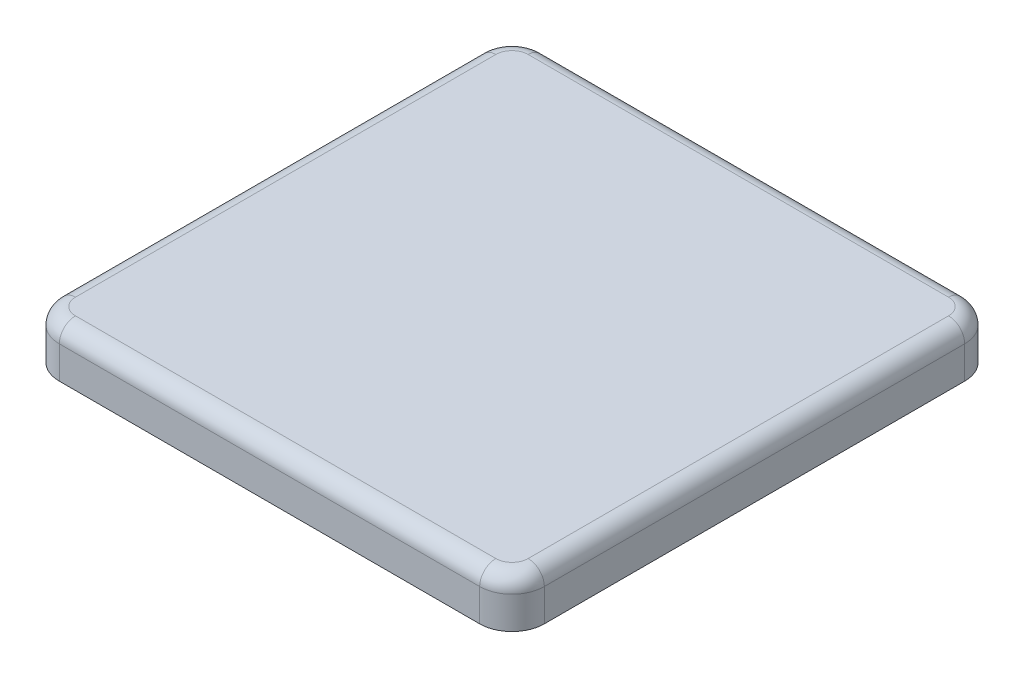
from build123d import *

# Parameters (mm, degrees)
EXTRUDE_1_DEPTH     = 1.5
FILLET_1_R          = 1
CUT_EXTRUDE_2_DEPTH = 1
SKETCH_3_W          = 1.6
SKETCH_3_H          = 6
EXTRUDE_3_DEPTH     = 2.5
SKETCH_4_W          = 3.3
SKETCH_4_H          = 4.9
EXTRUDE_4_DEPTH     = 8
EXTRUDE_4_TAPER     = 0.5
FILLET_2_R          = 0.8


with BuildPart() as part:
    # Sketch 1 → Extrude 1 (new, symmetric)
    with BuildSketch(Plane(origin=(0, 0, 0), x_dir=(0, 0, -1), z_dir=(0, 1, 0))):
        with BuildLine():
            Line((-13, 15), (13, 15))
            ThreePointArc((13, 15), (14.414213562, 14.414213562), (15, 13))
            Line((15, 13), (15, -13))
            ThreePointArc((15, -13), (14.414213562, -14.414213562), (13, -15))
            Line((13, -15), (-13, -15))
            ThreePointArc((-13, -15), (-14.414213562, -14.414213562), (-15, -13))
            Line((-15, -13), (-15, 13))
            ThreePointArc((-15, 13), (-14.414213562, 14.414213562), (-13, 15))
        make_face()
    extrude(amount=EXTRUDE_1_DEPTH, both=True)

    # Fillet 1
    fillet_1_edges = [part.edges().sort_by_distance(p)[0] for p in [
        (-14.414213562, 1.5, 14.414213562),
        (0, 1.5, 15),
        (14.414213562, 1.5, 14.414213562),
        (15, 1.5, 0),
        (14.414213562, 1.5, -14.414213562),
        (0, 1.5, -15),
        (-14.414213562, 1.5, -14.414213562),
        (-15, 1.5, 0),
    ]]
    fillet(fillet_1_edges, radius=FILLET_1_R)

    # Sketch 2 → Cut-Extrude 2 (cut)
    with BuildSketch(Plane.XZ.offset(1.5)):
        with BuildLine():
            Line((-13, 13.2), (13, 13.2))
            ThreePointArc((13, 13.2), (13.141421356, 13.141421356), (13.2, 13))
            Line((13.2, 13), (13.2, -13))
            ThreePointArc((13.2, -13), (13.141421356, -13.141421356), (13, -13.2))
            Line((13, -13.2), (-13, -13.2))
            ThreePointArc((-13, -13.2), (-13.141421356, -13.141421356), (-13.2, -13))
            Line((-13.2, -13), (-13.2, 13))
            ThreePointArc((-13.2, 13), (-13.141421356, 13.141421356), (-13, 13.2))
        make_face()
    extrude(amount=-CUT_EXTRUDE_2_DEPTH, mode=Mode.SUBTRACT)

    # Sketch 3 → Extrude 3 (add)
    with BuildSketch(Plane.XZ.offset(0.5)):
        with Locations((-12.9, 0)):
            Rectangle(SKETCH_3_W, SKETCH_3_H)
    extrude(amount=EXTRUDE_3_DEPTH)

    # Sketch 4 → Extrude 4 (add)
    with BuildSketch(Plane.XZ.offset(0.5)):
        Rectangle(SKETCH_4_W, SKETCH_4_H)
    extrude(amount=EXTRUDE_4_DEPTH, taper=EXTRUDE_4_TAPER)

    # Fillet 2
    fillet_2_edges = [part.edges().sort_by_distance(p)[0] for p in [
        (-1.580185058, -8.5, 0),
        (0, -8.5, -2.380185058),
        (1.580185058, -8.5, 0),
        (0, -8.5, 2.380185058),
    ]]
    fillet(fillet_2_edges, radius=FILLET_2_R)


solid = part.part
